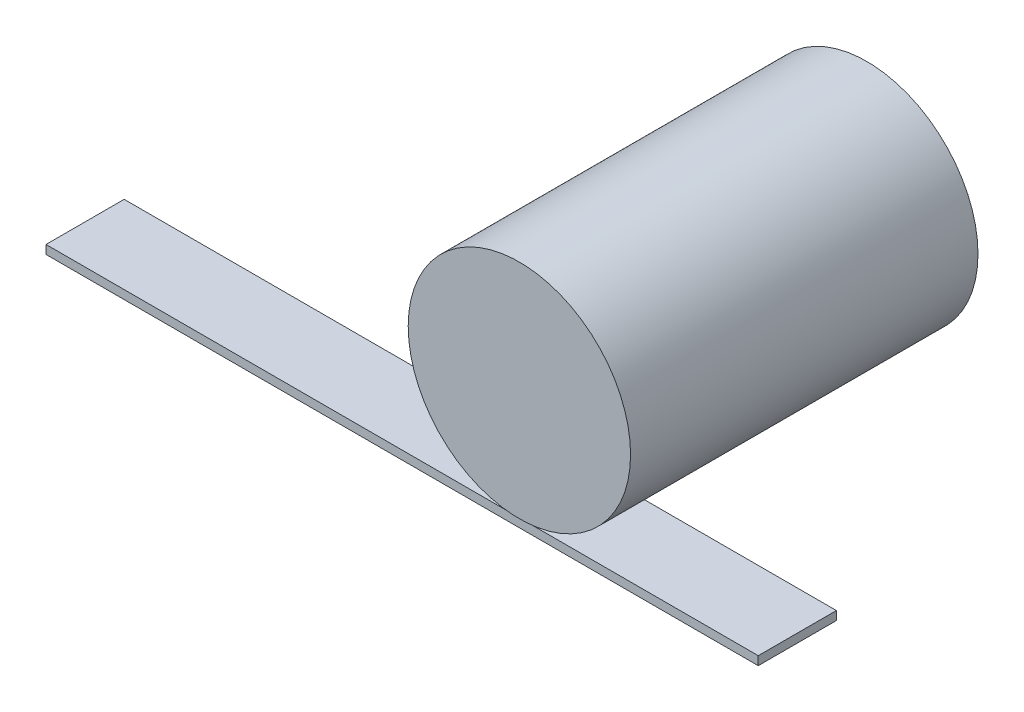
ISO-10303-21;
HEADER;
FILE_DESCRIPTION(('STEP AP214'),'2;1');
FILE_NAME('part.step','',(''),(''),'','','');
FILE_SCHEMA(('AUTOMOTIVE_DESIGN { 1 0 10303 214 1 1 1 1 }'));
ENDSEC;
DATA;
#1=APPLICATION_CONTEXT('core data for automotive mechanical design processes');
#2=APPLICATION_PROTOCOL_DEFINITION('international standard','automotive_design',2000,#1);
#3=PRODUCT_CONTEXT('',#1,'mechanical');
#4=PRODUCT('Part','Part','',(#3));
#5=PRODUCT_RELATED_PRODUCT_CATEGORY('part','',(#4));
#6=PRODUCT_DEFINITION_FORMATION('','',#4);
#7=PRODUCT_DEFINITION_CONTEXT('part definition',#1,'design');
#8=PRODUCT_DEFINITION('design','',#6,#7);
#9=PRODUCT_DEFINITION_SHAPE('','',#8);
#10=(LENGTH_UNIT() NAMED_UNIT(*) SI_UNIT(.MILLI.,.METRE.));
#11=(NAMED_UNIT(*) PLANE_ANGLE_UNIT() SI_UNIT($,.RADIAN.));
#12=(NAMED_UNIT(*) SI_UNIT($,.STERADIAN.) SOLID_ANGLE_UNIT());
#13=UNCERTAINTY_MEASURE_WITH_UNIT(LENGTH_MEASURE(1.E-05),#10,'distance_accuracy_value','');
#14=(GEOMETRIC_REPRESENTATION_CONTEXT(3) GLOBAL_UNCERTAINTY_ASSIGNED_CONTEXT((#13)) GLOBAL_UNIT_ASSIGNED_CONTEXT((#10,
#11,#12)) REPRESENTATION_CONTEXT('',''));
#15=CARTESIAN_POINT('',(0.,0.,0.));
#16=DIRECTION('',(0.,0.,1.));
#17=DIRECTION('',(1.,0.,0.));
#18=AXIS2_PLACEMENT_3D('',#15,#16,#17);
#19=CARTESIAN_POINT('',(-300.,-96.,-2.5));
#20=DIRECTION('',(-1.,0.,0.));
#21=DIRECTION('',(0.,0.,1.));
#22=AXIS2_PLACEMENT_3D('',#19,#20,#21);
#23=PLANE('',#22);
#24=DIRECTION('',(0.,0.,1.));
#25=VECTOR('',#24,1.);
#26=CARTESIAN_POINT('',(-300.,-91.,-2.5));
#27=LINE('',#26,#25);
#28=CARTESIAN_POINT('',(-300.,-91.,-2.5));
#29=VERTEX_POINT('',#28);
#30=CARTESIAN_POINT('',(-300.,-91.,42.5));
#31=VERTEX_POINT('',#30);
#32=EDGE_CURVE('E105',#29,#31,#27,.T.);
#33=ORIENTED_EDGE('',*,*,#32,.F.);
#34=DIRECTION('',(0.,1.,0.));
#35=VECTOR('',#34,1.);
#36=CARTESIAN_POINT('',(-300.,-96.,-2.5));
#37=LINE('',#36,#35);
#38=CARTESIAN_POINT('',(-300.,-96.,-2.5));
#39=VERTEX_POINT('',#38);
#40=EDGE_CURVE('E12',#39,#29,#37,.T.);
#41=ORIENTED_EDGE('',*,*,#40,.F.);
#42=DIRECTION('',(0.,0.,1.));
#43=VECTOR('',#42,1.);
#44=CARTESIAN_POINT('',(-300.,-96.,-2.5));
#45=LINE('',#44,#43);
#46=CARTESIAN_POINT('',(-300.,-96.,42.5));
#47=VERTEX_POINT('',#46);
#48=EDGE_CURVE('E99',#39,#47,#45,.T.);
#49=ORIENTED_EDGE('',*,*,#48,.T.);
#50=DIRECTION('',(0.,1.,0.));
#51=VECTOR('',#50,1.);
#52=CARTESIAN_POINT('',(-300.,-96.,42.5));
#53=LINE('',#52,#51);
#54=EDGE_CURVE('E44',#47,#31,#53,.T.);
#55=ORIENTED_EDGE('',*,*,#54,.T.);
#56=EDGE_LOOP('',(#33,#41,#49,#55));
#57=FACE_BOUND('',#56,.T.);
#58=ADVANCED_FACE('F41',(#57),#23,.T.);
#59=CARTESIAN_POINT('',(-300.,-96.,-2.5));
#60=DIRECTION('',(0.,0.,-1.));
#61=DIRECTION('',(-1.,0.,0.));
#62=AXIS2_PLACEMENT_3D('',#59,#60,#61);
#63=PLANE('',#62);
#64=DIRECTION('',(-1.,0.,0.));
#65=VECTOR('',#64,1.);
#66=CARTESIAN_POINT('',(-300.,-91.,-2.5));
#67=LINE('',#66,#65);
#68=CARTESIAN_POINT('',(110.,-91.,-2.5));
#69=VERTEX_POINT('',#68);
#70=EDGE_CURVE('E101',#69,#29,#67,.T.);
#71=ORIENTED_EDGE('',*,*,#70,.F.);
#72=DIRECTION('',(0.,1.,0.));
#73=VECTOR('',#72,1.);
#74=CARTESIAN_POINT('',(110.,-96.,-2.5));
#75=LINE('',#74,#73);
#76=CARTESIAN_POINT('',(110.,-96.,-2.5));
#77=VERTEX_POINT('',#76);
#78=EDGE_CURVE('E50',#77,#69,#75,.T.);
#79=ORIENTED_EDGE('',*,*,#78,.F.);
#80=DIRECTION('',(-1.,0.,0.));
#81=VECTOR('',#80,1.);
#82=CARTESIAN_POINT('',(-300.,-96.,-2.5));
#83=LINE('',#82,#81);
#84=EDGE_CURVE('E96',#77,#39,#83,.T.);
#85=ORIENTED_EDGE('',*,*,#84,.T.);
#86=ORIENTED_EDGE('',*,*,#40,.T.);
#87=EDGE_LOOP('',(#71,#79,#85,#86));
#88=FACE_BOUND('',#87,.T.);
#89=ADVANCED_FACE('F115',(#88),#63,.T.);
#90=CARTESIAN_POINT('',(110.,-96.,-2.5));
#91=DIRECTION('',(1.,0.,0.));
#92=DIRECTION('',(0.,0.,-1.));
#93=AXIS2_PLACEMENT_3D('',#90,#91,#92);
#94=PLANE('',#93);
#95=DIRECTION('',(0.,0.,-1.));
#96=VECTOR('',#95,1.);
#97=CARTESIAN_POINT('',(110.,-91.,-2.5));
#98=LINE('',#97,#96);
#99=CARTESIAN_POINT('',(110.,-91.,42.5));
#100=VERTEX_POINT('',#99);
#101=EDGE_CURVE('E91',#100,#69,#98,.T.);
#102=ORIENTED_EDGE('',*,*,#101,.F.);
#103=DIRECTION('',(0.,1.,0.));
#104=VECTOR('',#103,1.);
#105=CARTESIAN_POINT('',(110.,-96.,42.5));
#106=LINE('',#105,#104);
#107=CARTESIAN_POINT('',(110.,-96.,42.5));
#108=VERTEX_POINT('',#107);
#109=EDGE_CURVE('E86',#108,#100,#106,.T.);
#110=ORIENTED_EDGE('',*,*,#109,.F.);
#111=DIRECTION('',(0.,0.,-1.));
#112=VECTOR('',#111,1.);
#113=CARTESIAN_POINT('',(110.,-96.,-2.5));
#114=LINE('',#113,#112);
#115=EDGE_CURVE('E89',#108,#77,#114,.T.);
#116=ORIENTED_EDGE('',*,*,#115,.T.);
#117=ORIENTED_EDGE('',*,*,#78,.T.);
#118=EDGE_LOOP('',(#102,#110,#116,#117));
#119=FACE_BOUND('',#118,.T.);
#120=ADVANCED_FACE('F88',(#119),#94,.T.);
#121=CARTESIAN_POINT('',(-300.,-96.,42.5));
#122=DIRECTION('',(0.,0.,1.));
#123=DIRECTION('',(1.,0.,0.));
#124=AXIS2_PLACEMENT_3D('',#121,#122,#123);
#125=PLANE('',#124);
#126=DIRECTION('',(1.,0.,0.));
#127=VECTOR('',#126,1.);
#128=CARTESIAN_POINT('',(-300.,-91.,42.5));
#129=LINE('',#128,#127);
#130=EDGE_CURVE('E108',#31,#100,#129,.T.);
#131=ORIENTED_EDGE('',*,*,#130,.F.);
#132=ORIENTED_EDGE('',*,*,#54,.F.);
#133=DIRECTION('',(1.,0.,0.));
#134=VECTOR('',#133,1.);
#135=CARTESIAN_POINT('',(-300.,-96.,42.5));
#136=LINE('',#135,#134);
#137=EDGE_CURVE('E95',#47,#108,#136,.T.);
#138=ORIENTED_EDGE('',*,*,#137,.T.);
#139=ORIENTED_EDGE('',*,*,#109,.T.);
#140=EDGE_LOOP('',(#131,#132,#138,#139));
#141=FACE_BOUND('',#140,.T.);
#142=ADVANCED_FACE('F98',(#141),#125,.T.);
#143=CARTESIAN_POINT('',(0.,-96.,0.));
#144=DIRECTION('',(0.,1.,0.));
#145=DIRECTION('',(0.,0.,1.));
#146=AXIS2_PLACEMENT_3D('',#143,#144,#145);
#147=PLANE('',#146);
#148=ORIENTED_EDGE('',*,*,#48,.F.);
#149=ORIENTED_EDGE('',*,*,#84,.F.);
#150=ORIENTED_EDGE('',*,*,#115,.F.);
#151=ORIENTED_EDGE('',*,*,#137,.F.);
#152=EDGE_LOOP('',(#148,#149,#150,#151));
#153=FACE_BOUND('',#152,.T.);
#154=ADVANCED_FACE('F94',(#153),#147,.F.);
#155=CARTESIAN_POINT('',(0.,-91.,0.));
#156=DIRECTION('',(0.,1.,0.));
#157=DIRECTION('',(0.,0.,1.));
#158=AXIS2_PLACEMENT_3D('',#155,#156,#157);
#159=PLANE('',#158);
#160=ORIENTED_EDGE('',*,*,#32,.T.);
#161=ORIENTED_EDGE('',*,*,#130,.T.);
#162=ORIENTED_EDGE('',*,*,#101,.T.);
#163=ORIENTED_EDGE('',*,*,#70,.T.);
#164=EDGE_LOOP('',(#160,#161,#162,#163));
#165=FACE_BOUND('',#164,.T.);
#166=ADVANCED_FACE('F114',(#165),#159,.T.);
#167=CLOSED_SHELL('',(#58,#89,#120,#142,#154,#166));
#168=MANIFOLD_SOLID_BREP('B2',#167);
#169=CARTESIAN_POINT('',(0.,0.,-130.));
#170=DIRECTION('',(0.,0.,1.));
#171=DIRECTION('',(1.,0.,0.));
#172=AXIS2_PLACEMENT_3D('',#169,#170,#171);
#173=CYLINDRICAL_SURFACE('',#172,64.);
#174=CARTESIAN_POINT('',(0.,0.,-130.));
#175=DIRECTION('',(0.,0.,1.));
#176=DIRECTION('',(1.,0.,0.));
#177=AXIS2_PLACEMENT_3D('',#174,#175,#176);
#178=CIRCLE('',#177,64.);
#179=CARTESIAN_POINT('',(64.,0.,-130.));
#180=VERTEX_POINT('',#179);
#181=EDGE_CURVE('E40',#180,#180,#178,.T.);
#182=ORIENTED_EDGE('',*,*,#181,.T.);
#183=EDGE_LOOP('',(#182));
#184=FACE_BOUND('',#183,.T.);
#185=CARTESIAN_POINT('',(0.,0.,70.));
#186=DIRECTION('',(0.,0.,1.));
#187=DIRECTION('',(1.,0.,0.));
#188=AXIS2_PLACEMENT_3D('',#185,#186,#187);
#189=CIRCLE('',#188,64.);
#190=CARTESIAN_POINT('',(64.,0.,70.));
#191=VERTEX_POINT('',#190);
#192=EDGE_CURVE('E171',#191,#191,#189,.T.);
#193=ORIENTED_EDGE('',*,*,#192,.F.);
#194=EDGE_LOOP('',(#193));
#195=FACE_BOUND('',#194,.T.);
#196=ADVANCED_FACE('F165',(#184,#195),#173,.T.);
#197=CARTESIAN_POINT('',(0.,0.,-130.));
#198=DIRECTION('',(0.,0.,1.));
#199=DIRECTION('',(1.,0.,0.));
#200=AXIS2_PLACEMENT_3D('',#197,#198,#199);
#201=PLANE('',#200);
#202=ORIENTED_EDGE('',*,*,#181,.F.);
#203=EDGE_LOOP('',(#202));
#204=FACE_BOUND('',#203,.T.);
#205=ADVANCED_FACE('F180',(#204),#201,.F.);
#206=CARTESIAN_POINT('',(0.,0.,70.));
#207=DIRECTION('',(0.,0.,1.));
#208=DIRECTION('',(1.,0.,0.));
#209=AXIS2_PLACEMENT_3D('',#206,#207,#208);
#210=PLANE('',#209);
#211=ORIENTED_EDGE('',*,*,#192,.T.);
#212=EDGE_LOOP('',(#211));
#213=FACE_BOUND('',#212,.T.);
#214=ADVANCED_FACE('F177',(#213),#210,.T.);
#215=CLOSED_SHELL('',(#196,#205,#214));
#216=MANIFOLD_SOLID_BREP('B6',#215);
#217=ADVANCED_BREP_SHAPE_REPRESENTATION('',(#18,#168,#216),#14);
#218=SHAPE_DEFINITION_REPRESENTATION(#9,#217);
ENDSEC;
END-ISO-10303-21;
